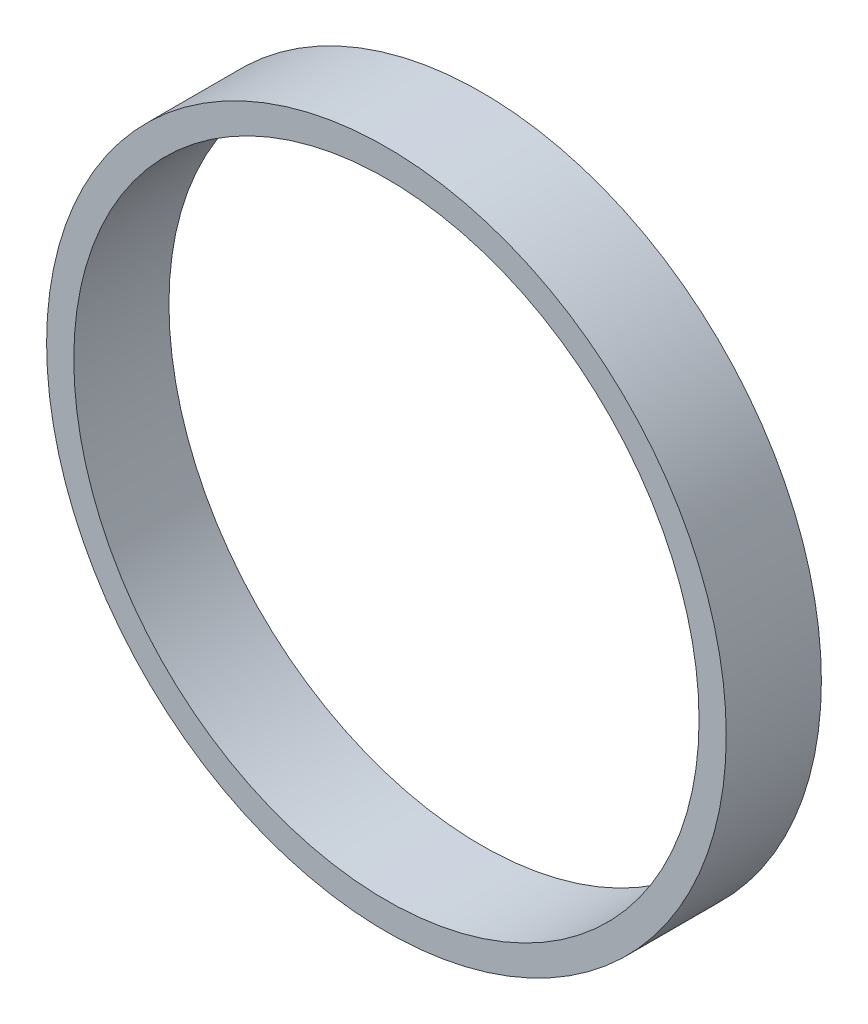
from build123d import *

# Parameters (mm, degrees)
SKETCH1_R           = 25
SKETCH1_R_2         = 23
BOSS_EXTRUDE1_DEPTH = 7


with BuildPart() as part:
    # Sketch1 → Boss-Extrude1 (new body)
    with BuildSketch(Plane.XY):
        Circle(SKETCH1_R)
        Circle(SKETCH1_R_2, mode=Mode.SUBTRACT)
    extrude(amount=BOSS_EXTRUDE1_DEPTH)


solid = part.part
